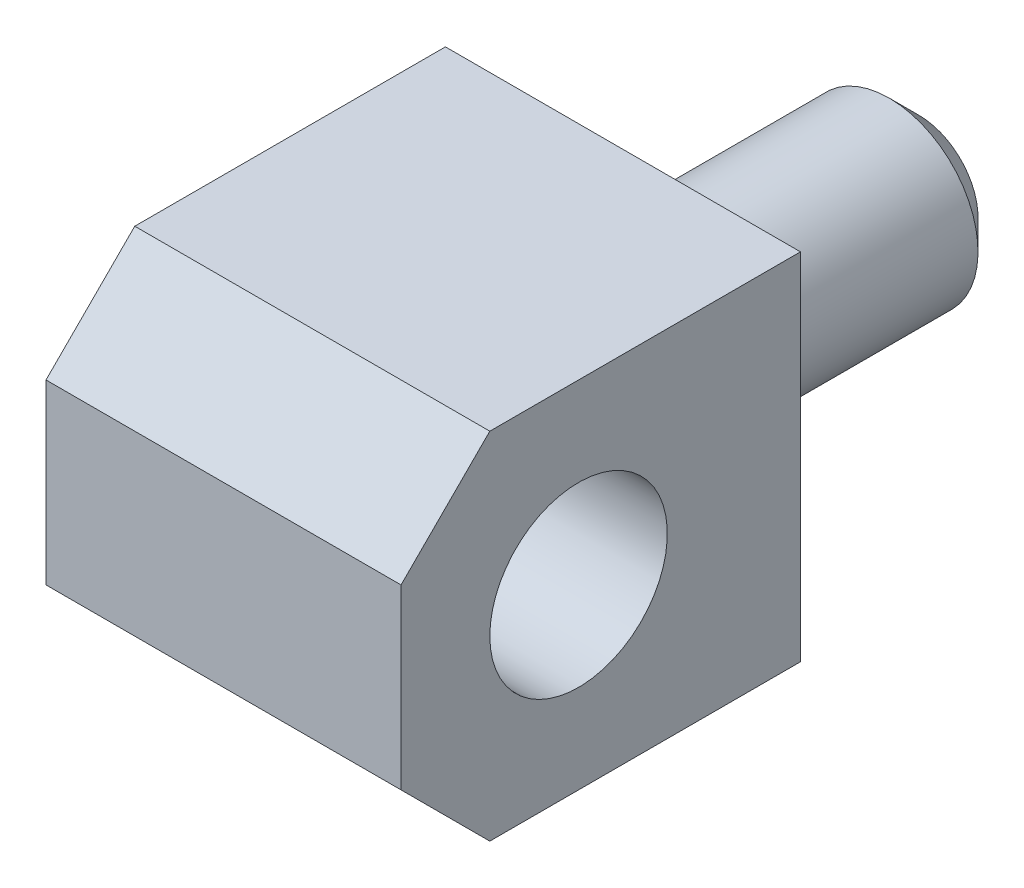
ISO-10303-21;
HEADER;
FILE_DESCRIPTION(('STEP AP214'),'2;1');
FILE_NAME('part.step','',(''),(''),'','','');
FILE_SCHEMA(('AUTOMOTIVE_DESIGN { 1 0 10303 214 1 1 1 1 }'));
ENDSEC;
DATA;
#1=APPLICATION_CONTEXT('core data for automotive mechanical design processes');
#2=APPLICATION_PROTOCOL_DEFINITION('international standard','automotive_design',2000,#1);
#3=PRODUCT_CONTEXT('',#1,'mechanical');
#4=PRODUCT('Part','Part','',(#3));
#5=PRODUCT_RELATED_PRODUCT_CATEGORY('part','',(#4));
#6=PRODUCT_DEFINITION_FORMATION('','',#4);
#7=PRODUCT_DEFINITION_CONTEXT('part definition',#1,'design');
#8=PRODUCT_DEFINITION('design','',#6,#7);
#9=PRODUCT_DEFINITION_SHAPE('','',#8);
#10=(LENGTH_UNIT() NAMED_UNIT(*) SI_UNIT(.MILLI.,.METRE.));
#11=(NAMED_UNIT(*) PLANE_ANGLE_UNIT() SI_UNIT($,.RADIAN.));
#12=(NAMED_UNIT(*) SI_UNIT($,.STERADIAN.) SOLID_ANGLE_UNIT());
#13=UNCERTAINTY_MEASURE_WITH_UNIT(LENGTH_MEASURE(1.E-05),#10,'distance_accuracy_value','');
#14=(GEOMETRIC_REPRESENTATION_CONTEXT(3) GLOBAL_UNCERTAINTY_ASSIGNED_CONTEXT((#13)) GLOBAL_UNIT_ASSIGNED_CONTEXT((#10,
#11,#12)) REPRESENTATION_CONTEXT('',''));
#15=CARTESIAN_POINT('',(0.,0.,0.));
#16=DIRECTION('',(0.,0.,1.));
#17=DIRECTION('',(1.,0.,0.));
#18=AXIS2_PLACEMENT_3D('',#15,#16,#17);
#19=CARTESIAN_POINT('',(6.,6.,0.5));
#20=DIRECTION('',(0.,-1.,0.));
#21=DIRECTION('',(1.,0.,0.));
#22=AXIS2_PLACEMENT_3D('',#19,#20,#21);
#23=PLANE('',#22);
#24=DIRECTION('',(0.,0.,1.));
#25=VECTOR('',#24,1.);
#26=CARTESIAN_POINT('',(-6.,6.,0.5));
#27=LINE('',#26,#25);
#28=CARTESIAN_POINT('',(-6.,6.,0.));
#29=VERTEX_POINT('',#28);
#30=CARTESIAN_POINT('',(-6.,6.,10.5));
#31=VERTEX_POINT('',#30);
#32=EDGE_CURVE('E68',#29,#31,#27,.T.);
#33=ORIENTED_EDGE('',*,*,#32,.T.);
#34=DIRECTION('',(1.,0.,0.));
#35=VECTOR('',#34,1.);
#36=CARTESIAN_POINT('',(6.,6.,10.5));
#37=LINE('',#36,#35);
#38=CARTESIAN_POINT('',(6.,6.,10.5));
#39=VERTEX_POINT('',#38);
#40=EDGE_CURVE('E29',#31,#39,#37,.T.);
#41=ORIENTED_EDGE('',*,*,#40,.T.);
#42=DIRECTION('',(0.,0.,1.));
#43=VECTOR('',#42,1.);
#44=CARTESIAN_POINT('',(6.,6.,0.5));
#45=LINE('',#44,#43);
#46=CARTESIAN_POINT('',(6.,6.,0.));
#47=VERTEX_POINT('',#46);
#48=EDGE_CURVE('E81',#47,#39,#45,.T.);
#49=ORIENTED_EDGE('',*,*,#48,.F.);
#50=DIRECTION('',(1.,0.,0.));
#51=VECTOR('',#50,1.);
#52=CARTESIAN_POINT('',(-6.,6.,0.));
#53=LINE('',#52,#51);
#54=EDGE_CURVE('E80',#29,#47,#53,.T.);
#55=ORIENTED_EDGE('',*,*,#54,.F.);
#56=EDGE_LOOP('',(#33,#41,#49,#55));
#57=FACE_BOUND('',#56,.T.);
#58=ADVANCED_FACE('F14',(#57),#23,.F.);
#59=CARTESIAN_POINT('',(6.,-6.,13.5));
#60=DIRECTION('',(0.,0.,1.));
#61=DIRECTION('',(-1.,0.,0.));
#62=AXIS2_PLACEMENT_3D('',#59,#60,#61);
#63=PLANE('',#62);
#64=DIRECTION('',(0.,1.,0.));
#65=VECTOR('',#64,1.);
#66=CARTESIAN_POINT('',(-6.,-6.,13.5));
#67=LINE('',#66,#65);
#68=CARTESIAN_POINT('',(-6.,-3.,13.5));
#69=VERTEX_POINT('',#68);
#70=CARTESIAN_POINT('',(-6.,2.99999999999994,13.5));
#71=VERTEX_POINT('',#70);
#72=EDGE_CURVE('E77',#69,#71,#67,.T.);
#73=ORIENTED_EDGE('',*,*,#72,.F.);
#74=DIRECTION('',(1.,0.,0.));
#75=VECTOR('',#74,1.);
#76=CARTESIAN_POINT('',(6.,-3.,13.5));
#77=LINE('',#76,#75);
#78=CARTESIAN_POINT('',(6.,-3.,13.5));
#79=VERTEX_POINT('',#78);
#80=EDGE_CURVE('E118',#69,#79,#77,.T.);
#81=ORIENTED_EDGE('',*,*,#80,.T.);
#82=DIRECTION('',(0.,1.,0.));
#83=VECTOR('',#82,1.);
#84=CARTESIAN_POINT('',(6.,-6.,13.5));
#85=LINE('',#84,#83);
#86=CARTESIAN_POINT('',(6.,2.99999999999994,13.5));
#87=VERTEX_POINT('',#86);
#88=EDGE_CURVE('E106',#79,#87,#85,.T.);
#89=ORIENTED_EDGE('',*,*,#88,.T.);
#90=DIRECTION('',(-1.,0.,0.));
#91=VECTOR('',#90,1.);
#92=CARTESIAN_POINT('',(-6.,2.99999999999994,13.5));
#93=LINE('',#92,#91);
#94=EDGE_CURVE('E115',#87,#71,#93,.T.);
#95=ORIENTED_EDGE('',*,*,#94,.T.);
#96=EDGE_LOOP('',(#73,#81,#89,#95));
#97=FACE_BOUND('',#96,.T.);
#98=ADVANCED_FACE('F140',(#97),#63,.T.);
#99=CARTESIAN_POINT('',(6.,-6.,13.5));
#100=DIRECTION('',(0.,1.,0.));
#101=DIRECTION('',(0.,0.,1.));
#102=AXIS2_PLACEMENT_3D('',#99,#100,#101);
#103=PLANE('',#102);
#104=DIRECTION('',(0.,0.,-1.));
#105=VECTOR('',#104,1.);
#106=CARTESIAN_POINT('',(6.,-6.,13.5));
#107=LINE('',#106,#105);
#108=CARTESIAN_POINT('',(6.,-6.,10.5));
#109=VERTEX_POINT('',#108);
#110=CARTESIAN_POINT('',(6.,-6.,0.));
#111=VERTEX_POINT('',#110);
#112=EDGE_CURVE('E76',#109,#111,#107,.T.);
#113=ORIENTED_EDGE('',*,*,#112,.F.);
#114=DIRECTION('',(-1.,0.,0.));
#115=VECTOR('',#114,1.);
#116=CARTESIAN_POINT('',(-6.,-6.,10.5));
#117=LINE('',#116,#115);
#118=CARTESIAN_POINT('',(-6.,-6.,10.5));
#119=VERTEX_POINT('',#118);
#120=EDGE_CURVE('E109',#109,#119,#117,.T.);
#121=ORIENTED_EDGE('',*,*,#120,.T.);
#122=DIRECTION('',(0.,0.,-1.));
#123=VECTOR('',#122,1.);
#124=CARTESIAN_POINT('',(-6.,-6.,13.5));
#125=LINE('',#124,#123);
#126=CARTESIAN_POINT('',(-6.,-6.,0.));
#127=VERTEX_POINT('',#126);
#128=EDGE_CURVE('E102',#119,#127,#125,.T.);
#129=ORIENTED_EDGE('',*,*,#128,.T.);
#130=DIRECTION('',(-1.,0.,0.));
#131=VECTOR('',#130,1.);
#132=CARTESIAN_POINT('',(6.,-6.,0.));
#133=LINE('',#132,#131);
#134=EDGE_CURVE('E90',#111,#127,#133,.T.);
#135=ORIENTED_EDGE('',*,*,#134,.F.);
#136=EDGE_LOOP('',(#113,#121,#129,#135));
#137=FACE_BOUND('',#136,.T.);
#138=ADVANCED_FACE('F144',(#137),#103,.F.);
#139=CARTESIAN_POINT('',(6.,6.,0.5));
#140=DIRECTION('',(-1.,0.,0.));
#141=DIRECTION('',(0.,0.,-1.));
#142=AXIS2_PLACEMENT_3D('',#139,#140,#141);
#143=PLANE('',#142);
#144=CARTESIAN_POINT('',(6.,0.,7.5));
#145=DIRECTION('',(1.,0.,0.));
#146=DIRECTION('',(0.,0.,1.));
#147=AXIS2_PLACEMENT_3D('',#144,#145,#146);
#148=CIRCLE('',#147,3.);
#149=CARTESIAN_POINT('',(6.,0.,10.5));
#150=VERTEX_POINT('',#149);
#151=EDGE_CURVE('E96',#150,#150,#148,.T.);
#152=ORIENTED_EDGE('',*,*,#151,.F.);
#153=EDGE_LOOP('',(#152));
#154=FACE_BOUND('',#153,.T.);
#155=ORIENTED_EDGE('',*,*,#88,.F.);
#156=DIRECTION('',(0.,-0.707106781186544,-0.707106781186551));
#157=VECTOR('',#156,1.);
#158=CARTESIAN_POINT('',(6.,-6.,10.5));
#159=LINE('',#158,#157);
#160=EDGE_CURVE('E121',#79,#109,#159,.T.);
#161=ORIENTED_EDGE('',*,*,#160,.T.);
#162=ORIENTED_EDGE('',*,*,#112,.T.);
#163=DIRECTION('',(0.,-1.,0.));
#164=VECTOR('',#163,1.);
#165=CARTESIAN_POINT('',(6.,6.,0.));
#166=LINE('',#165,#164);
#167=EDGE_CURVE('E85',#47,#111,#166,.T.);
#168=ORIENTED_EDGE('',*,*,#167,.F.);
#169=ORIENTED_EDGE('',*,*,#48,.T.);
#170=DIRECTION('',(0.,-0.707106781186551,0.707106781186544));
#171=VECTOR('',#170,1.);
#172=CARTESIAN_POINT('',(6.,2.99999999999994,13.5));
#173=LINE('',#172,#171);
#174=EDGE_CURVE('E36',#39,#87,#173,.T.);
#175=ORIENTED_EDGE('',*,*,#174,.T.);
#176=EDGE_LOOP('',(#155,#161,#162,#168,#169,#175));
#177=FACE_BOUND('',#176,.T.);
#178=ADVANCED_FACE('F147',(#154,#177),#143,.F.);
#179=CARTESIAN_POINT('',(-6.,6.,0.5));
#180=DIRECTION('',(-1.,0.,0.));
#181=DIRECTION('',(0.,0.,-1.));
#182=AXIS2_PLACEMENT_3D('',#179,#180,#181);
#183=PLANE('',#182);
#184=ORIENTED_EDGE('',*,*,#128,.F.);
#185=DIRECTION('',(0.,0.707106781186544,0.707106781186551));
#186=VECTOR('',#185,1.);
#187=CARTESIAN_POINT('',(-6.,-5.,11.5));
#188=LINE('',#187,#186);
#189=EDGE_CURVE('E113',#119,#69,#188,.T.);
#190=ORIENTED_EDGE('',*,*,#189,.T.);
#191=ORIENTED_EDGE('',*,*,#72,.T.);
#192=DIRECTION('',(0.,0.707106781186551,-0.707106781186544));
#193=VECTOR('',#192,1.);
#194=CARTESIAN_POINT('',(-6.,11.,5.5));
#195=LINE('',#194,#193);
#196=EDGE_CURVE('E75',#71,#31,#195,.T.);
#197=ORIENTED_EDGE('',*,*,#196,.T.);
#198=ORIENTED_EDGE('',*,*,#32,.F.);
#199=DIRECTION('',(0.,1.,0.));
#200=VECTOR('',#199,1.);
#201=CARTESIAN_POINT('',(-6.,-6.,0.));
#202=LINE('',#201,#200);
#203=EDGE_CURVE('E73',#127,#29,#202,.T.);
#204=ORIENTED_EDGE('',*,*,#203,.F.);
#205=EDGE_LOOP('',(#184,#190,#191,#197,#198,#204));
#206=FACE_BOUND('',#205,.T.);
#207=ADVANCED_FACE('F71',(#206),#183,.T.);
#208=CARTESIAN_POINT('',(6.,-6.,10.5));
#209=DIRECTION('',(0.,-0.707106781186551,0.707106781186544));
#210=DIRECTION('',(0.,-0.707106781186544,-0.707106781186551));
#211=AXIS2_PLACEMENT_3D('',#208,#209,#210);
#212=PLANE('',#211);
#213=ORIENTED_EDGE('',*,*,#160,.F.);
#214=ORIENTED_EDGE('',*,*,#80,.F.);
#215=ORIENTED_EDGE('',*,*,#189,.F.);
#216=ORIENTED_EDGE('',*,*,#120,.F.);
#217=EDGE_LOOP('',(#213,#214,#215,#216));
#218=FACE_BOUND('',#217,.T.);
#219=ADVANCED_FACE('F157',(#218),#212,.T.);
#220=CARTESIAN_POINT('',(6.,2.99999999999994,13.5));
#221=DIRECTION('',(0.,0.707106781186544,0.707106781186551));
#222=DIRECTION('',(0.,-0.707106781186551,0.707106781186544));
#223=AXIS2_PLACEMENT_3D('',#220,#221,#222);
#224=PLANE('',#223);
#225=ORIENTED_EDGE('',*,*,#174,.F.);
#226=ORIENTED_EDGE('',*,*,#40,.F.);
#227=ORIENTED_EDGE('',*,*,#196,.F.);
#228=ORIENTED_EDGE('',*,*,#94,.F.);
#229=EDGE_LOOP('',(#225,#226,#227,#228));
#230=FACE_BOUND('',#229,.T.);
#231=ADVANCED_FACE('F160',(#230),#224,.T.);
#232=CARTESIAN_POINT('',(-2.,0.,7.5));
#233=DIRECTION('',(1.,0.,0.));
#234=DIRECTION('',(0.,0.,1.));
#235=AXIS2_PLACEMENT_3D('',#232,#233,#234);
#236=CYLINDRICAL_SURFACE('',#235,3.);
#237=CARTESIAN_POINT('',(-2.,0.,7.5));
#238=DIRECTION('',(1.,0.,0.));
#239=DIRECTION('',(0.,0.,1.));
#240=AXIS2_PLACEMENT_3D('',#237,#238,#239);
#241=CIRCLE('',#240,3.);
#242=CARTESIAN_POINT('',(-2.,0.,10.5));
#243=VERTEX_POINT('',#242);
#244=EDGE_CURVE('E99',#243,#243,#241,.T.);
#245=ORIENTED_EDGE('',*,*,#244,.F.);
#246=EDGE_LOOP('',(#245));
#247=FACE_BOUND('',#246,.T.);
#248=ORIENTED_EDGE('',*,*,#151,.T.);
#249=EDGE_LOOP('',(#248));
#250=FACE_BOUND('',#249,.T.);
#251=ADVANCED_FACE('F164',(#247,#250),#236,.F.);
#252=CARTESIAN_POINT('',(-2.,0.,7.5));
#253=DIRECTION('',(1.,0.,0.));
#254=DIRECTION('',(0.,0.,1.));
#255=AXIS2_PLACEMENT_3D('',#252,#253,#254);
#256=PLANE('',#255);
#257=ORIENTED_EDGE('',*,*,#244,.T.);
#258=EDGE_LOOP('',(#257));
#259=FACE_BOUND('',#258,.T.);
#260=ADVANCED_FACE('F166',(#259),#256,.T.);
#261=CARTESIAN_POINT('',(0.,0.,0.));
#262=DIRECTION('',(0.,0.,-1.));
#263=DIRECTION('',(0.,1.,0.));
#264=AXIS2_PLACEMENT_3D('',#261,#262,#263);
#265=PLANE('',#264);
#266=CARTESIAN_POINT('',(0.,0.,0.));
#267=DIRECTION('',(0.,0.,-1.));
#268=DIRECTION('',(0.,1.,0.));
#269=AXIS2_PLACEMENT_3D('',#266,#267,#268);
#270=CIRCLE('',#269,3.);
#271=CARTESIAN_POINT('',(0.,3.,0.));
#272=VERTEX_POINT('',#271);
#273=EDGE_CURVE('E95',#272,#272,#270,.T.);
#274=ORIENTED_EDGE('',*,*,#273,.F.);
#275=EDGE_LOOP('',(#274));
#276=FACE_BOUND('',#275,.T.);
#277=ORIENTED_EDGE('',*,*,#203,.T.);
#278=ORIENTED_EDGE('',*,*,#54,.T.);
#279=ORIENTED_EDGE('',*,*,#167,.T.);
#280=ORIENTED_EDGE('',*,*,#134,.T.);
#281=EDGE_LOOP('',(#277,#278,#279,#280));
#282=FACE_BOUND('',#281,.T.);
#283=ADVANCED_FACE('F88',(#276,#282),#265,.T.);
#284=CARTESIAN_POINT('',(0.,0.,-9.5));
#285=DIRECTION('',(0.,0.,1.));
#286=DIRECTION('',(-1.,0.,0.));
#287=AXIS2_PLACEMENT_3D('',#284,#285,#286);
#288=CYLINDRICAL_SURFACE('',#287,3.);
#289=CARTESIAN_POINT('',(0.,0.,-9.));
#290=DIRECTION('',(0.,0.,-1.));
#291=DIRECTION('',(0.,1.,0.));
#292=AXIS2_PLACEMENT_3D('',#289,#290,#291);
#293=CIRCLE('',#292,3.);
#294=CARTESIAN_POINT('',(0.,3.,-9.));
#295=VERTEX_POINT('',#294);
#296=EDGE_CURVE('E9',#295,#295,#293,.F.);
#297=ORIENTED_EDGE('',*,*,#296,.T.);
#298=EDGE_LOOP('',(#297));
#299=FACE_BOUND('',#298,.T.);
#300=ORIENTED_EDGE('',*,*,#273,.T.);
#301=EDGE_LOOP('',(#300));
#302=FACE_BOUND('',#301,.T.);
#303=ADVANCED_FACE('F136',(#299,#302),#288,.T.);
#304=CARTESIAN_POINT('',(0.,0.,-10.));
#305=DIRECTION('',(0.,0.,-1.));
#306=DIRECTION('',(0.,1.,0.));
#307=AXIS2_PLACEMENT_3D('',#304,#305,#306);
#308=PLANE('',#307);
#309=CARTESIAN_POINT('',(0.,0.,-10.));
#310=DIRECTION('',(0.,0.,-1.));
#311=DIRECTION('',(0.,1.,0.));
#312=AXIS2_PLACEMENT_3D('',#309,#310,#311);
#313=CIRCLE('',#312,2.);
#314=CARTESIAN_POINT('',(0.,2.,-10.));
#315=VERTEX_POINT('',#314);
#316=EDGE_CURVE('E22',#315,#315,#313,.T.);
#317=ORIENTED_EDGE('',*,*,#316,.T.);
#318=EDGE_LOOP('',(#317));
#319=FACE_BOUND('',#318,.T.);
#320=ADVANCED_FACE('F128',(#319),#308,.T.);
#321=CARTESIAN_POINT('',(0.,0.,-10.));
#322=DIRECTION('',(0.,0.,1.));
#323=DIRECTION('',(0.,-1.,0.));
#324=AXIS2_PLACEMENT_3D('',#321,#322,#323);
#325=CONICAL_SURFACE('',#324,2.,0.785398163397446);
#326=ORIENTED_EDGE('',*,*,#296,.F.);
#327=EDGE_LOOP('',(#326));
#328=FACE_BOUND('',#327,.T.);
#329=ORIENTED_EDGE('',*,*,#316,.F.);
#330=EDGE_LOOP('',(#329));
#331=FACE_BOUND('',#330,.T.);
#332=ADVANCED_FACE('F16',(#328,#331),#325,.T.);
#333=CLOSED_SHELL('',(#58,#98,#138,#178,#207,#219,#231,#251,#260,#283,#303,#320,#332));
#334=MANIFOLD_SOLID_BREP('B1',#333);
#335=ADVANCED_BREP_SHAPE_REPRESENTATION('',(#18,#334),#14);
#336=SHAPE_DEFINITION_REPRESENTATION(#9,#335);
ENDSEC;
END-ISO-10303-21;
